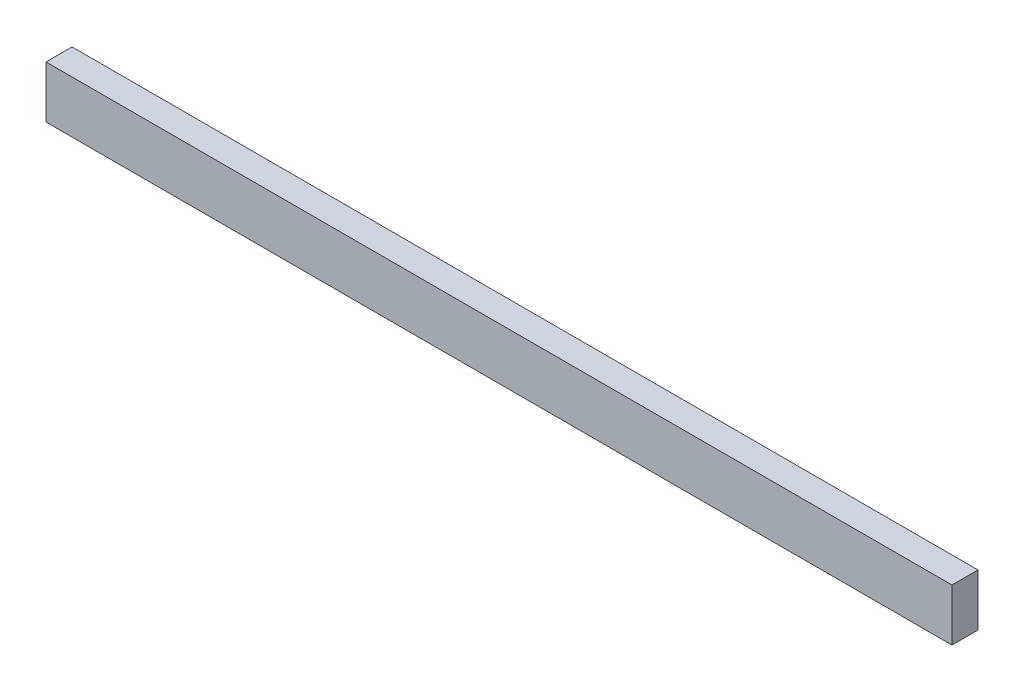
ISO-10303-21;
HEADER;
FILE_DESCRIPTION(('STEP AP214'),'2;1');
FILE_NAME('part.step','',(''),(''),'','','');
FILE_SCHEMA(('AUTOMOTIVE_DESIGN { 1 0 10303 214 1 1 1 1 }'));
ENDSEC;
DATA;
#1=APPLICATION_CONTEXT('core data for automotive mechanical design processes');
#2=APPLICATION_PROTOCOL_DEFINITION('international standard','automotive_design',2000,#1);
#3=PRODUCT_CONTEXT('',#1,'mechanical');
#4=PRODUCT('Part','Part','',(#3));
#5=PRODUCT_RELATED_PRODUCT_CATEGORY('part','',(#4));
#6=PRODUCT_DEFINITION_FORMATION('','',#4);
#7=PRODUCT_DEFINITION_CONTEXT('part definition',#1,'design');
#8=PRODUCT_DEFINITION('design','',#6,#7);
#9=PRODUCT_DEFINITION_SHAPE('','',#8);
#10=(LENGTH_UNIT() NAMED_UNIT(*) SI_UNIT(.MILLI.,.METRE.));
#11=(NAMED_UNIT(*) PLANE_ANGLE_UNIT() SI_UNIT($,.RADIAN.));
#12=(NAMED_UNIT(*) SI_UNIT($,.STERADIAN.) SOLID_ANGLE_UNIT());
#13=UNCERTAINTY_MEASURE_WITH_UNIT(LENGTH_MEASURE(1.E-05),#10,'distance_accuracy_value','');
#14=(GEOMETRIC_REPRESENTATION_CONTEXT(3) GLOBAL_UNCERTAINTY_ASSIGNED_CONTEXT((#13)) GLOBAL_UNIT_ASSIGNED_CONTEXT((#10,
#11,#12)) REPRESENTATION_CONTEXT('',''));
#15=CARTESIAN_POINT('',(0.,0.,0.));
#16=DIRECTION('',(0.,0.,1.));
#17=DIRECTION('',(1.,0.,0.));
#18=AXIS2_PLACEMENT_3D('',#15,#16,#17);
#19=CARTESIAN_POINT('',(435.,25.,25.));
#20=DIRECTION('',(-1.,0.,0.));
#21=DIRECTION('',(0.,0.,1.));
#22=AXIS2_PLACEMENT_3D('',#19,#20,#21);
#23=PLANE('',#22);
#24=DIRECTION('',(0.,1.,0.));
#25=VECTOR('',#24,1.);
#26=CARTESIAN_POINT('',(435.,25.,0.));
#27=LINE('',#26,#25);
#28=CARTESIAN_POINT('',(435.,-25.,0.));
#29=VERTEX_POINT('',#28);
#30=CARTESIAN_POINT('',(435.,25.,0.));
#31=VERTEX_POINT('',#30);
#32=EDGE_CURVE('E102',#29,#31,#27,.T.);
#33=ORIENTED_EDGE('',*,*,#32,.T.);
#34=DIRECTION('',(0.,0.,-1.));
#35=VECTOR('',#34,1.);
#36=CARTESIAN_POINT('',(435.,25.,25.));
#37=LINE('',#36,#35);
#38=CARTESIAN_POINT('',(435.,25.,25.));
#39=VERTEX_POINT('',#38);
#40=EDGE_CURVE('E11',#39,#31,#37,.T.);
#41=ORIENTED_EDGE('',*,*,#40,.F.);
#42=DIRECTION('',(0.,1.,0.));
#43=VECTOR('',#42,1.);
#44=CARTESIAN_POINT('',(435.,25.,25.));
#45=LINE('',#44,#43);
#46=CARTESIAN_POINT('',(435.,-25.,25.));
#47=VERTEX_POINT('',#46);
#48=EDGE_CURVE('E90',#47,#39,#45,.T.);
#49=ORIENTED_EDGE('',*,*,#48,.F.);
#50=DIRECTION('',(0.,0.,-1.));
#51=VECTOR('',#50,1.);
#52=CARTESIAN_POINT('',(435.,-25.,25.));
#53=LINE('',#52,#51);
#54=EDGE_CURVE('E98',#47,#29,#53,.T.);
#55=ORIENTED_EDGE('',*,*,#54,.T.);
#56=EDGE_LOOP('',(#33,#41,#49,#55));
#57=FACE_BOUND('',#56,.T.);
#58=ADVANCED_FACE('F39',(#57),#23,.F.);
#59=CARTESIAN_POINT('',(-435.,25.,25.));
#60=DIRECTION('',(0.,-1.,0.));
#61=DIRECTION('',(0.,0.,-1.));
#62=AXIS2_PLACEMENT_3D('',#59,#60,#61);
#63=PLANE('',#62);
#64=DIRECTION('',(-1.,0.,0.));
#65=VECTOR('',#64,1.);
#66=CARTESIAN_POINT('',(-435.,25.,0.));
#67=LINE('',#66,#65);
#68=CARTESIAN_POINT('',(-435.,25.,0.));
#69=VERTEX_POINT('',#68);
#70=EDGE_CURVE('E94',#31,#69,#67,.T.);
#71=ORIENTED_EDGE('',*,*,#70,.T.);
#72=DIRECTION('',(0.,0.,-1.));
#73=VECTOR('',#72,1.);
#74=CARTESIAN_POINT('',(-435.,25.,25.));
#75=LINE('',#74,#73);
#76=CARTESIAN_POINT('',(-435.,25.,25.));
#77=VERTEX_POINT('',#76);
#78=EDGE_CURVE('E47',#77,#69,#75,.T.);
#79=ORIENTED_EDGE('',*,*,#78,.F.);
#80=DIRECTION('',(-1.,0.,0.));
#81=VECTOR('',#80,1.);
#82=CARTESIAN_POINT('',(-435.,25.,25.));
#83=LINE('',#82,#81);
#84=EDGE_CURVE('E85',#39,#77,#83,.T.);
#85=ORIENTED_EDGE('',*,*,#84,.F.);
#86=ORIENTED_EDGE('',*,*,#40,.T.);
#87=EDGE_LOOP('',(#71,#79,#85,#86));
#88=FACE_BOUND('',#87,.T.);
#89=ADVANCED_FACE('F93',(#88),#63,.F.);
#90=CARTESIAN_POINT('',(-435.,25.,25.));
#91=DIRECTION('',(1.,0.,0.));
#92=DIRECTION('',(0.,0.,-1.));
#93=AXIS2_PLACEMENT_3D('',#90,#91,#92);
#94=PLANE('',#93);
#95=DIRECTION('',(0.,-1.,0.));
#96=VECTOR('',#95,1.);
#97=CARTESIAN_POINT('',(-435.,25.,0.));
#98=LINE('',#97,#96);
#99=CARTESIAN_POINT('',(-435.,-25.,0.));
#100=VERTEX_POINT('',#99);
#101=EDGE_CURVE('E72',#69,#100,#98,.T.);
#102=ORIENTED_EDGE('',*,*,#101,.T.);
#103=DIRECTION('',(0.,0.,-1.));
#104=VECTOR('',#103,1.);
#105=CARTESIAN_POINT('',(-435.,-25.,25.));
#106=LINE('',#105,#104);
#107=CARTESIAN_POINT('',(-435.,-25.,25.));
#108=VERTEX_POINT('',#107);
#109=EDGE_CURVE('E95',#108,#100,#106,.T.);
#110=ORIENTED_EDGE('',*,*,#109,.F.);
#111=DIRECTION('',(0.,-1.,0.));
#112=VECTOR('',#111,1.);
#113=CARTESIAN_POINT('',(-435.,25.,25.));
#114=LINE('',#113,#112);
#115=EDGE_CURVE('E88',#77,#108,#114,.T.);
#116=ORIENTED_EDGE('',*,*,#115,.F.);
#117=ORIENTED_EDGE('',*,*,#78,.T.);
#118=EDGE_LOOP('',(#102,#110,#116,#117));
#119=FACE_BOUND('',#118,.T.);
#120=ADVANCED_FACE('F96',(#119),#94,.F.);
#121=CARTESIAN_POINT('',(-435.,-25.,25.));
#122=DIRECTION('',(0.,1.,0.));
#123=DIRECTION('',(0.,0.,1.));
#124=AXIS2_PLACEMENT_3D('',#121,#122,#123);
#125=PLANE('',#124);
#126=DIRECTION('',(1.,0.,0.));
#127=VECTOR('',#126,1.);
#128=CARTESIAN_POINT('',(-435.,-25.,0.));
#129=LINE('',#128,#127);
#130=EDGE_CURVE('E78',#100,#29,#129,.T.);
#131=ORIENTED_EDGE('',*,*,#130,.T.);
#132=ORIENTED_EDGE('',*,*,#54,.F.);
#133=DIRECTION('',(1.,0.,0.));
#134=VECTOR('',#133,1.);
#135=CARTESIAN_POINT('',(-435.,-25.,25.));
#136=LINE('',#135,#134);
#137=EDGE_CURVE('E55',#108,#47,#136,.T.);
#138=ORIENTED_EDGE('',*,*,#137,.F.);
#139=ORIENTED_EDGE('',*,*,#109,.T.);
#140=EDGE_LOOP('',(#131,#132,#138,#139));
#141=FACE_BOUND('',#140,.T.);
#142=ADVANCED_FACE('F109',(#141),#125,.F.);
#143=CARTESIAN_POINT('',(0.,0.,25.));
#144=DIRECTION('',(0.,0.,1.));
#145=DIRECTION('',(1.,0.,0.));
#146=AXIS2_PLACEMENT_3D('',#143,#144,#145);
#147=PLANE('',#146);
#148=ORIENTED_EDGE('',*,*,#48,.T.);
#149=ORIENTED_EDGE('',*,*,#84,.T.);
#150=ORIENTED_EDGE('',*,*,#115,.T.);
#151=ORIENTED_EDGE('',*,*,#137,.T.);
#152=EDGE_LOOP('',(#148,#149,#150,#151));
#153=FACE_BOUND('',#152,.T.);
#154=ADVANCED_FACE('F86',(#153),#147,.T.);
#155=CARTESIAN_POINT('',(0.,0.,0.));
#156=DIRECTION('',(0.,0.,1.));
#157=DIRECTION('',(1.,0.,0.));
#158=AXIS2_PLACEMENT_3D('',#155,#156,#157);
#159=PLANE('',#158);
#160=ORIENTED_EDGE('',*,*,#32,.F.);
#161=ORIENTED_EDGE('',*,*,#130,.F.);
#162=ORIENTED_EDGE('',*,*,#101,.F.);
#163=ORIENTED_EDGE('',*,*,#70,.F.);
#164=EDGE_LOOP('',(#160,#161,#162,#163));
#165=FACE_BOUND('',#164,.T.);
#166=ADVANCED_FACE('F112',(#165),#159,.F.);
#167=CLOSED_SHELL('',(#58,#89,#120,#142,#154,#166));
#168=MANIFOLD_SOLID_BREP('B2',#167);
#169=ADVANCED_BREP_SHAPE_REPRESENTATION('',(#18,#168),#14);
#170=SHAPE_DEFINITION_REPRESENTATION(#9,#169);
ENDSEC;
END-ISO-10303-21;
